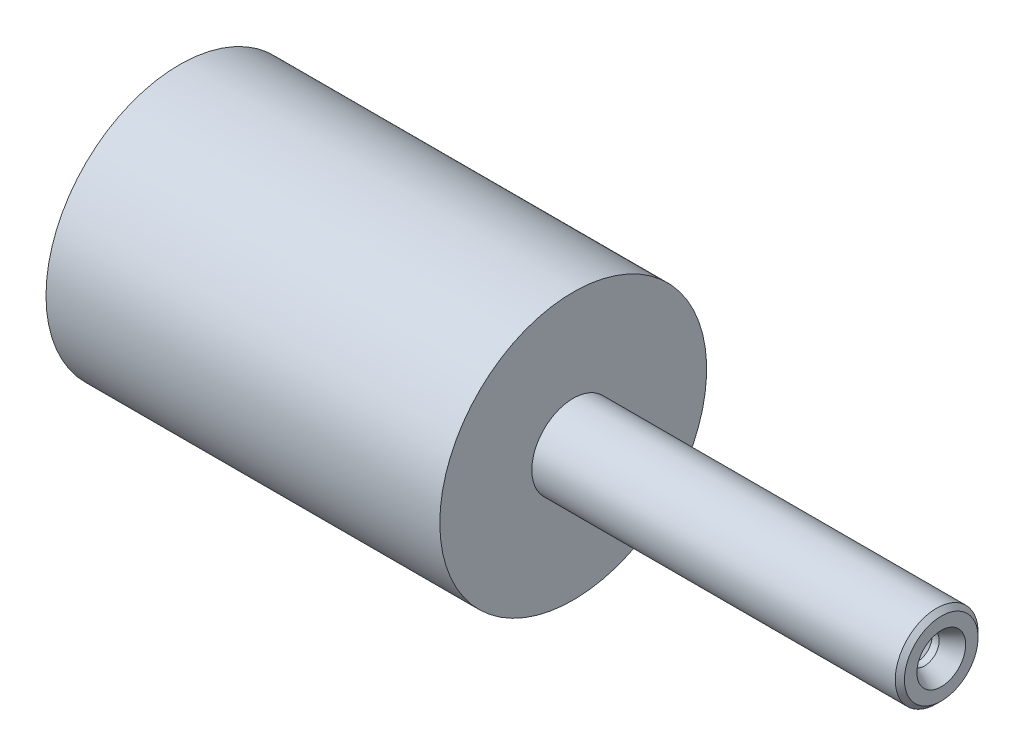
ISO-10303-21;
HEADER;
FILE_DESCRIPTION(('STEP AP214'),'2;1');
FILE_NAME('part.step','',(''),(''),'','','');
FILE_SCHEMA(('AUTOMOTIVE_DESIGN { 1 0 10303 214 1 1 1 1 }'));
ENDSEC;
DATA;
#1=APPLICATION_CONTEXT('core data for automotive mechanical design processes');
#2=APPLICATION_PROTOCOL_DEFINITION('international standard','automotive_design',2000,#1);
#3=PRODUCT_CONTEXT('',#1,'mechanical');
#4=PRODUCT('Part','Part','',(#3));
#5=PRODUCT_RELATED_PRODUCT_CATEGORY('part','',(#4));
#6=PRODUCT_DEFINITION_FORMATION('','',#4);
#7=PRODUCT_DEFINITION_CONTEXT('part definition',#1,'design');
#8=PRODUCT_DEFINITION('design','',#6,#7);
#9=PRODUCT_DEFINITION_SHAPE('','',#8);
#10=(LENGTH_UNIT() NAMED_UNIT(*) SI_UNIT(.MILLI.,.METRE.));
#11=(NAMED_UNIT(*) PLANE_ANGLE_UNIT() SI_UNIT($,.RADIAN.));
#12=(NAMED_UNIT(*) SI_UNIT($,.STERADIAN.) SOLID_ANGLE_UNIT());
#13=UNCERTAINTY_MEASURE_WITH_UNIT(LENGTH_MEASURE(1.E-05),#10,'distance_accuracy_value','');
#14=(GEOMETRIC_REPRESENTATION_CONTEXT(3) GLOBAL_UNCERTAINTY_ASSIGNED_CONTEXT((#13)) GLOBAL_UNIT_ASSIGNED_CONTEXT((#10,
#11,#12)) REPRESENTATION_CONTEXT('',''));
#15=CARTESIAN_POINT('',(0.,0.,0.));
#16=DIRECTION('',(0.,0.,1.));
#17=DIRECTION('',(1.,0.,0.));
#18=AXIS2_PLACEMENT_3D('',#15,#16,#17);
#19=CARTESIAN_POINT('',(20.,4.,0.));
#20=DIRECTION('',(-1.,0.,0.));
#21=DIRECTION('',(0.,0.,1.));
#22=AXIS2_PLACEMENT_3D('',#19,#20,#21);
#23=PLANE('',#22);
#24=CARTESIAN_POINT('',(20.,0.,0.));
#25=DIRECTION('',(-1.,0.,0.));
#26=DIRECTION('',(0.,0.,1.));
#27=AXIS2_PLACEMENT_3D('',#24,#25,#26);
#28=CIRCLE('',#27,4.);
#29=CARTESIAN_POINT('',(20.,0.,4.));
#30=VERTEX_POINT('',#29);
#31=EDGE_CURVE('E40',#30,#30,#28,.T.);
#32=ORIENTED_EDGE('',*,*,#31,.F.);
#33=EDGE_LOOP('',(#32));
#34=FACE_BOUND('',#33,.T.);
#35=CARTESIAN_POINT('',(20.,0.,0.));
#36=DIRECTION('',(-1.,0.,0.));
#37=DIRECTION('',(0.,0.,1.));
#38=AXIS2_PLACEMENT_3D('',#35,#36,#37);
#39=CIRCLE('',#38,2.65);
#40=CARTESIAN_POINT('',(20.,0.,2.65));
#41=VERTEX_POINT('',#40);
#42=EDGE_CURVE('E69',#41,#41,#39,.T.);
#43=ORIENTED_EDGE('',*,*,#42,.T.);
#44=EDGE_LOOP('',(#43));
#45=FACE_BOUND('',#44,.T.);
#46=ADVANCED_FACE('F33',(#34,#45),#23,.F.);
#47=CARTESIAN_POINT('',(20.,0.,0.));
#48=DIRECTION('',(-1.,0.,0.));
#49=DIRECTION('',(0.,0.,1.));
#50=AXIS2_PLACEMENT_3D('',#47,#48,#49);
#51=CYLINDRICAL_SURFACE('',#50,4.5);
#52=CARTESIAN_POINT('',(19.5,0.,0.));
#53=DIRECTION('',(-1.,0.,0.));
#54=DIRECTION('',(0.,0.,1.));
#55=AXIS2_PLACEMENT_3D('',#52,#53,#54);
#56=CIRCLE('',#55,4.5);
#57=CARTESIAN_POINT('',(19.5,0.,4.5));
#58=VERTEX_POINT('',#57);
#59=EDGE_CURVE('E11',#58,#58,#56,.T.);
#60=ORIENTED_EDGE('',*,*,#59,.T.);
#61=EDGE_LOOP('',(#60));
#62=FACE_BOUND('',#61,.T.);
#63=CARTESIAN_POINT('',(-20.,0.,0.));
#64=DIRECTION('',(-1.,0.,0.));
#65=DIRECTION('',(0.,0.,1.));
#66=AXIS2_PLACEMENT_3D('',#63,#64,#65);
#67=CIRCLE('',#66,4.5);
#68=CARTESIAN_POINT('',(-20.,0.,4.5));
#69=VERTEX_POINT('',#68);
#70=EDGE_CURVE('E54',#69,#69,#67,.T.);
#71=ORIENTED_EDGE('',*,*,#70,.F.);
#72=EDGE_LOOP('',(#71));
#73=FACE_BOUND('',#72,.T.);
#74=ADVANCED_FACE('F35',(#62,#73),#51,.T.);
#75=CARTESIAN_POINT('',(20.,0.,0.));
#76=DIRECTION('',(-1.,0.,0.));
#77=DIRECTION('',(0.,0.,1.));
#78=AXIS2_PLACEMENT_3D('',#75,#76,#77);
#79=CONICAL_SURFACE('',#78,4.,0.785398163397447);
#80=ORIENTED_EDGE('',*,*,#59,.F.);
#81=EDGE_LOOP('',(#80));
#82=FACE_BOUND('',#81,.T.);
#83=ORIENTED_EDGE('',*,*,#31,.T.);
#84=EDGE_LOOP('',(#83));
#85=FACE_BOUND('',#84,.T.);
#86=ADVANCED_FACE('F74',(#82,#85),#79,.T.);
#87=CARTESIAN_POINT('',(20.,0.,0.));
#88=DIRECTION('',(1.,0.,0.));
#89=DIRECTION('',(0.,0.,-1.));
#90=AXIS2_PLACEMENT_3D('',#87,#88,#89);
#91=CONICAL_SURFACE('',#90,2.65,0.523598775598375);
#92=CARTESIAN_POINT('',(18.181346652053,0.,0.));
#93=DIRECTION('',(-1.,0.,0.));
#94=DIRECTION('',(0.,0.,1.));
#95=AXIS2_PLACEMENT_3D('',#92,#93,#94);
#96=CIRCLE('',#95,1.6);
#97=CARTESIAN_POINT('',(18.181346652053,0.,1.6));
#98=VERTEX_POINT('',#97);
#99=EDGE_CURVE('E66',#98,#98,#96,.T.);
#100=ORIENTED_EDGE('',*,*,#99,.T.);
#101=EDGE_LOOP('',(#100));
#102=FACE_BOUND('',#101,.T.);
#103=ORIENTED_EDGE('',*,*,#42,.F.);
#104=EDGE_LOOP('',(#103));
#105=FACE_BOUND('',#104,.T.);
#106=ADVANCED_FACE('F81',(#102,#105),#91,.F.);
#107=CARTESIAN_POINT('',(20.,0.,0.));
#108=DIRECTION('',(-1.,0.,0.));
#109=DIRECTION('',(0.,0.,1.));
#110=AXIS2_PLACEMENT_3D('',#107,#108,#109);
#111=CYLINDRICAL_SURFACE('',#110,1.6);
#112=CARTESIAN_POINT('',(17.4,0.,0.));
#113=DIRECTION('',(-1.,0.,0.));
#114=DIRECTION('',(0.,0.,1.));
#115=AXIS2_PLACEMENT_3D('',#112,#113,#114);
#116=CIRCLE('',#115,1.6);
#117=CARTESIAN_POINT('',(17.4,0.,1.6));
#118=VERTEX_POINT('',#117);
#119=EDGE_CURVE('E57',#118,#118,#116,.T.);
#120=ORIENTED_EDGE('',*,*,#119,.T.);
#121=EDGE_LOOP('',(#120));
#122=FACE_BOUND('',#121,.T.);
#123=ORIENTED_EDGE('',*,*,#99,.F.);
#124=EDGE_LOOP('',(#123));
#125=FACE_BOUND('',#124,.T.);
#126=ADVANCED_FACE('F83',(#122,#125),#111,.F.);
#127=CARTESIAN_POINT('',(17.4,0.,0.));
#128=DIRECTION('',(1.,0.,0.));
#129=DIRECTION('',(0.,0.,-1.));
#130=AXIS2_PLACEMENT_3D('',#127,#128,#129);
#131=CONICAL_SURFACE('',#130,1.6,0.78539816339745);
#132=CARTESIAN_POINT('',(17.0295,0.,0.));
#133=DIRECTION('',(-1.,0.,0.));
#134=DIRECTION('',(0.,0.,1.));
#135=AXIS2_PLACEMENT_3D('',#132,#133,#134);
#136=CIRCLE('',#135,1.2295);
#137=CARTESIAN_POINT('',(17.0295,0.,1.2295));
#138=VERTEX_POINT('',#137);
#139=EDGE_CURVE('E53',#138,#138,#136,.T.);
#140=ORIENTED_EDGE('',*,*,#139,.T.);
#141=EDGE_LOOP('',(#140));
#142=FACE_BOUND('',#141,.T.);
#143=ORIENTED_EDGE('',*,*,#119,.F.);
#144=EDGE_LOOP('',(#143));
#145=FACE_BOUND('',#144,.T.);
#146=ADVANCED_FACE('F90',(#142,#145),#131,.F.);
#147=CARTESIAN_POINT('',(20.,0.,0.));
#148=DIRECTION('',(-1.,0.,0.));
#149=DIRECTION('',(0.,0.,1.));
#150=AXIS2_PLACEMENT_3D('',#147,#148,#149);
#151=CYLINDRICAL_SURFACE('',#150,1.2295);
#152=CARTESIAN_POINT('',(8.,0.,0.));
#153=DIRECTION('',(-1.,0.,0.));
#154=DIRECTION('',(0.,0.,1.));
#155=AXIS2_PLACEMENT_3D('',#152,#153,#154);
#156=CIRCLE('',#155,1.2295);
#157=CARTESIAN_POINT('',(8.,0.,1.2295));
#158=VERTEX_POINT('',#157);
#159=EDGE_CURVE('E51',#158,#158,#156,.T.);
#160=ORIENTED_EDGE('',*,*,#159,.T.);
#161=EDGE_LOOP('',(#160));
#162=FACE_BOUND('',#161,.T.);
#163=ORIENTED_EDGE('',*,*,#139,.F.);
#164=EDGE_LOOP('',(#163));
#165=FACE_BOUND('',#164,.T.);
#166=ADVANCED_FACE('F47',(#162,#165),#151,.F.);
#167=CARTESIAN_POINT('',(8.,0.,0.));
#168=DIRECTION('',(1.,0.,0.));
#169=DIRECTION('',(0.,0.,-1.));
#170=AXIS2_PLACEMENT_3D('',#167,#168,#169);
#171=CONICAL_SURFACE('',#170,1.2295,1.04719755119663);
#172=CARTESIAN_POINT('',(7.2901478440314,0.,0.));
#173=VERTEX_POINT('',#172);
#174=VERTEX_LOOP('',#173);
#175=FACE_BOUND('',#174,.T.);
#176=ORIENTED_EDGE('',*,*,#159,.F.);
#177=EDGE_LOOP('',(#176));
#178=FACE_BOUND('',#177,.T.);
#179=ADVANCED_FACE('F43',(#175,#178),#171,.F.);
#180=CARTESIAN_POINT('',(-20.,0.,0.));
#181=DIRECTION('',(-1.,0.,0.));
#182=DIRECTION('',(0.,0.,1.));
#183=AXIS2_PLACEMENT_3D('',#180,#181,#182);
#184=PLANE('',#183);
#185=CARTESIAN_POINT('',(-20.,0.,0.));
#186=DIRECTION('',(-1.,0.,0.));
#187=DIRECTION('',(0.,0.,1.));
#188=AXIS2_PLACEMENT_3D('',#185,#186,#187);
#189=CIRCLE('',#188,14.5);
#190=CARTESIAN_POINT('',(-20.,0.,14.5));
#191=VERTEX_POINT('',#190);
#192=EDGE_CURVE('E115',#191,#191,#189,.T.);
#193=ORIENTED_EDGE('',*,*,#192,.F.);
#194=EDGE_LOOP('',(#193));
#195=FACE_BOUND('',#194,.T.);
#196=ORIENTED_EDGE('',*,*,#70,.T.);
#197=EDGE_LOOP('',(#196));
#198=FACE_BOUND('',#197,.T.);
#199=ADVANCED_FACE('F46',(#195,#198),#184,.F.);
#200=CARTESIAN_POINT('',(-62.8,0.,0.));
#201=DIRECTION('',(1.,0.,0.));
#202=DIRECTION('',(0.,0.,-1.));
#203=AXIS2_PLACEMENT_3D('',#200,#201,#202);
#204=CYLINDRICAL_SURFACE('',#203,14.5);
#205=CARTESIAN_POINT('',(-62.8,0.,0.));
#206=DIRECTION('',(-1.,0.,0.));
#207=DIRECTION('',(0.,0.,1.));
#208=AXIS2_PLACEMENT_3D('',#205,#206,#207);
#209=CIRCLE('',#208,14.5);
#210=CARTESIAN_POINT('',(-62.8,0.,14.5));
#211=VERTEX_POINT('',#210);
#212=EDGE_CURVE('E60',#211,#211,#209,.T.);
#213=ORIENTED_EDGE('',*,*,#212,.F.);
#214=EDGE_LOOP('',(#213));
#215=FACE_BOUND('',#214,.T.);
#216=ORIENTED_EDGE('',*,*,#192,.T.);
#217=EDGE_LOOP('',(#216));
#218=FACE_BOUND('',#217,.T.);
#219=ADVANCED_FACE('F100',(#215,#218),#204,.T.);
#220=CARTESIAN_POINT('',(-62.8,0.,0.));
#221=DIRECTION('',(-1.,0.,0.));
#222=DIRECTION('',(0.,0.,1.));
#223=AXIS2_PLACEMENT_3D('',#220,#221,#222);
#224=PLANE('',#223);
#225=ORIENTED_EDGE('',*,*,#212,.T.);
#226=EDGE_LOOP('',(#225));
#227=FACE_BOUND('',#226,.T.);
#228=ADVANCED_FACE('F103',(#227),#224,.T.);
#229=CLOSED_SHELL('',(#46,#74,#86,#106,#126,#146,#166,#179,#199,#219,#228));
#230=MANIFOLD_SOLID_BREP('B2',#229);
#231=ADVANCED_BREP_SHAPE_REPRESENTATION('',(#18,#230),#14);
#232=SHAPE_DEFINITION_REPRESENTATION(#9,#231);
ENDSEC;
END-ISO-10303-21;
